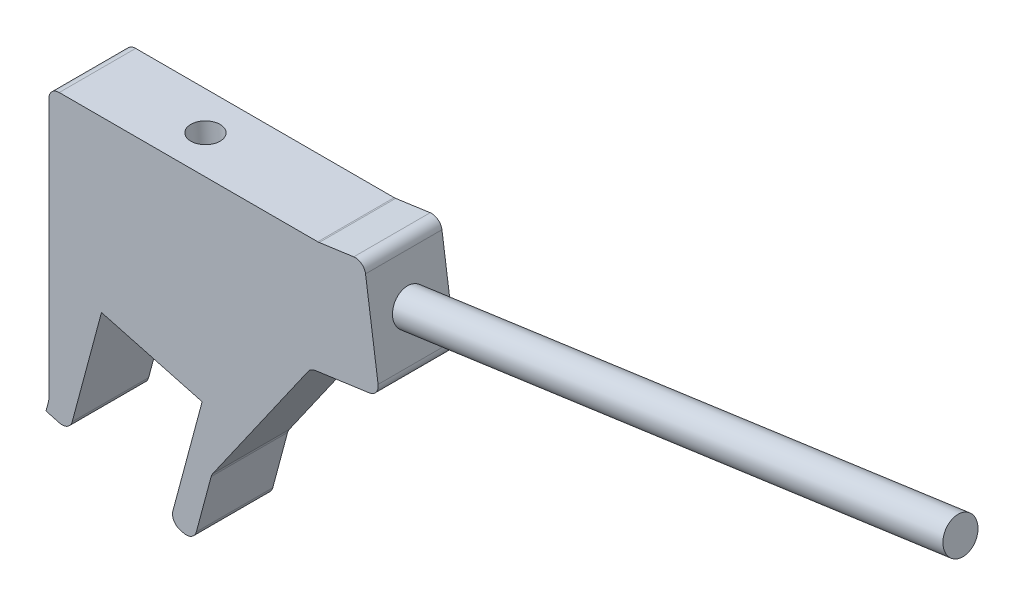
ISO-10303-21;
HEADER;
FILE_DESCRIPTION(('STEP AP214'),'2;1');
FILE_NAME('part.step','',(''),(''),'','','');
FILE_SCHEMA(('AUTOMOTIVE_DESIGN { 1 0 10303 214 1 1 1 1 }'));
ENDSEC;
DATA;
#1=APPLICATION_CONTEXT('core data for automotive mechanical design processes');
#2=APPLICATION_PROTOCOL_DEFINITION('international standard','automotive_design',2000,#1);
#3=PRODUCT_CONTEXT('',#1,'mechanical');
#4=PRODUCT('Part','Part','',(#3));
#5=PRODUCT_RELATED_PRODUCT_CATEGORY('part','',(#4));
#6=PRODUCT_DEFINITION_FORMATION('','',#4);
#7=PRODUCT_DEFINITION_CONTEXT('part definition',#1,'design');
#8=PRODUCT_DEFINITION('design','',#6,#7);
#9=PRODUCT_DEFINITION_SHAPE('','',#8);
#10=(LENGTH_UNIT() NAMED_UNIT(*) SI_UNIT(.MILLI.,.METRE.));
#11=(NAMED_UNIT(*) PLANE_ANGLE_UNIT() SI_UNIT($,.RADIAN.));
#12=(NAMED_UNIT(*) SI_UNIT($,.STERADIAN.) SOLID_ANGLE_UNIT());
#13=UNCERTAINTY_MEASURE_WITH_UNIT(LENGTH_MEASURE(1.E-05),#10,'distance_accuracy_value','');
#14=(GEOMETRIC_REPRESENTATION_CONTEXT(3) GLOBAL_UNCERTAINTY_ASSIGNED_CONTEXT((#13)) GLOBAL_UNIT_ASSIGNED_CONTEXT((#10,
#11,#12)) REPRESENTATION_CONTEXT('',''));
#15=CARTESIAN_POINT('',(0.,0.,0.));
#16=DIRECTION('',(0.,0.,1.));
#17=DIRECTION('',(1.,0.,0.));
#18=AXIS2_PLACEMENT_3D('',#15,#16,#17);
#19=CARTESIAN_POINT('',(-2.588190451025,-9.659258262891,-5.5));
#20=DIRECTION('',(-0.258819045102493,-0.965925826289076,0.));
#21=DIRECTION('',(0.965925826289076,-0.258819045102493,0.));
#22=AXIS2_PLACEMENT_3D('',#19,#20,#21);
#23=PLANE('',#22);
#24=CARTESIAN_POINT('',(-2.58819045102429,-9.65925826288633,0.));
#25=DIRECTION('',(-0.258819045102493,-0.965925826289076,0.));
#26=DIRECTION('',(0.965925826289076,-0.258819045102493,0.));
#27=AXIS2_PLACEMENT_3D('',#24,#25,#26);
#28=CIRCLE('',#27,1.6);
#29=CARTESIAN_POINT('',(-1.04270912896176,-10.0733687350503,0.));
#30=VERTEX_POINT('',#29);
#31=EDGE_CURVE('E306',#30,#30,#28,.T.);
#32=ORIENTED_EDGE('',*,*,#31,.T.);
#33=EDGE_LOOP('',(#32));
#34=FACE_BOUND('',#33,.T.);
#35=ADVANCED_FACE('F16',(#34),#23,.T.);
#36=CARTESIAN_POINT('',(105.1966057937,14.78441878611,0.));
#37=DIRECTION('',(0.990268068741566,0.139173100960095,0.));
#38=DIRECTION('',(-0.139173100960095,0.990268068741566,0.));
#39=AXIS2_PLACEMENT_3D('',#36,#37,#38);
#40=PLANE('',#39);
#41=CARTESIAN_POINT('',(105.709660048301,11.1338480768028,0.));
#42=DIRECTION('',(0.990268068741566,0.139173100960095,0.));
#43=DIRECTION('',(-0.139173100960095,0.990268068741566,0.));
#44=AXIS2_PLACEMENT_3D('',#41,#42,#43);
#45=CIRCLE('',#44,2.5);
#46=CARTESIAN_POINT('',(105.361727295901,13.6095182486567,0.));
#47=VERTEX_POINT('',#46);
#48=EDGE_CURVE('E370',#47,#47,#45,.F.);
#49=ORIENTED_EDGE('',*,*,#48,.F.);
#50=EDGE_LOOP('',(#49));
#51=FACE_BOUND('',#50,.T.);
#52=ADVANCED_FACE('F648',(#51),#40,.T.);
#53=CARTESIAN_POINT('',(0.,0.,0.));
#54=DIRECTION('',(-0.0697564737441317,0.997564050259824,0.));
#55=DIRECTION('',(-0.997564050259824,-0.0697564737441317,0.));
#56=AXIS2_PLACEMENT_3D('',#53,#54,#55);
#57=PLANE('',#56);
#58=CARTESIAN_POINT('',(-2.456985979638,-0.171809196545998,0.));
#59=DIRECTION('',(-0.0697564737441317,0.997564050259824,0.));
#60=DIRECTION('',(-0.997564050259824,-0.0697564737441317,0.));
#61=AXIS2_PLACEMENT_3D('',#58,#59,#60);
#62=CIRCLE('',#61,2.1);
#63=CARTESIAN_POINT('',(-4.55187048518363,-0.318297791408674,0.));
#64=VERTEX_POINT('',#63);
#65=EDGE_CURVE('E365',#64,#64,#62,.T.);
#66=ORIENTED_EDGE('',*,*,#65,.T.);
#67=EDGE_LOOP('',(#66));
#68=FACE_BOUND('',#67,.T.);
#69=ADVANCED_FACE('F641',(#68),#57,.T.);
#70=CARTESIAN_POINT('',(-21.5,-31.94280104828,-19.8396));
#71=DIRECTION('',(0.,0.,1.));
#72=DIRECTION('',(1.,0.,0.));
#73=AXIS2_PLACEMENT_3D('',#70,#71,#72);
#74=CYLINDRICAL_SURFACE('',#73,1.5);
#75=DIRECTION('',(0.,0.,1.));
#76=VECTOR('',#75,1.);
#77=CARTESIAN_POINT('',(-20.,-31.94280104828,-5.5));
#78=LINE('',#77,#76);
#79=CARTESIAN_POINT('',(-20.,-31.94280104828,-5.5));
#80=VERTEX_POINT('',#79);
#81=CARTESIAN_POINT('',(-20.,-31.94280104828,5.5));
#82=VERTEX_POINT('',#81);
#83=EDGE_CURVE('E185',#80,#82,#78,.T.);
#84=ORIENTED_EDGE('',*,*,#83,.F.);
#85=CARTESIAN_POINT('',(-21.5,-31.94280104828,-5.5));
#86=DIRECTION('',(0.,0.,1.));
#87=DIRECTION('',(1.,0.,0.));
#88=AXIS2_PLACEMENT_3D('',#85,#86,#87);
#89=CIRCLE('',#88,1.5);
#90=CARTESIAN_POINT('',(-20.051111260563,-32.3310296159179,-5.5));
#91=VERTEX_POINT('',#90);
#92=EDGE_CURVE('E363',#80,#91,#89,.F.);
#93=ORIENTED_EDGE('',*,*,#92,.T.);
#94=DIRECTION('',(0.,0.,1.));
#95=VECTOR('',#94,1.);
#96=CARTESIAN_POINT('',(-20.0511112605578,-32.3310296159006,-5.5));
#97=LINE('',#96,#95);
#98=CARTESIAN_POINT('',(-20.0511112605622,-32.3310296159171,5.5));
#99=VERTEX_POINT('',#98);
#100=EDGE_CURVE('E174',#99,#91,#97,.F.);
#101=ORIENTED_EDGE('',*,*,#100,.F.);
#102=CARTESIAN_POINT('',(-21.5,-31.94280104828,5.5));
#103=DIRECTION('',(0.,0.,1.));
#104=DIRECTION('',(1.,0.,0.));
#105=AXIS2_PLACEMENT_3D('',#102,#103,#104);
#106=CIRCLE('',#105,1.5);
#107=EDGE_CURVE('E20',#82,#99,#106,.F.);
#108=ORIENTED_EDGE('',*,*,#107,.F.);
#109=EDGE_LOOP('',(#84,#93,#101,#108));
#110=FACE_BOUND('',#109,.T.);
#111=ADVANCED_FACE('F634',(#110),#74,.F.);
#112=CARTESIAN_POINT('',(-20.,-32.14027979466,-5.5));
#113=DIRECTION('',(-0.965925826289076,0.258819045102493,0.));
#114=DIRECTION('',(-0.258819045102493,-0.965925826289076,0.));
#115=AXIS2_PLACEMENT_3D('',#112,#113,#114);
#116=PLANE('',#115);
#117=DIRECTION('',(-0.258819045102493,-0.965925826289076,0.));
#118=VECTOR('',#117,1.);
#119=CARTESIAN_POINT('',(-20.,-32.14027979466,5.5));
#120=LINE('',#119,#118);
#121=CARTESIAN_POINT('',(-20.4051736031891,-33.6524082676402,5.5));
#122=VERTEX_POINT('',#121);
#123=EDGE_CURVE('E165',#122,#99,#120,.F.);
#124=ORIENTED_EDGE('',*,*,#123,.T.);
#125=ORIENTED_EDGE('',*,*,#100,.T.);
#126=DIRECTION('',(-0.258819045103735,-0.965925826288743,0.));
#127=VECTOR('',#126,1.);
#128=CARTESIAN_POINT('',(-20.05111126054,-32.33102961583,-5.5));
#129=LINE('',#128,#127);
#130=CARTESIAN_POINT('',(-20.40517360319,-33.65240826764,-5.5));
#131=VERTEX_POINT('',#130);
#132=EDGE_CURVE('E181',#91,#131,#129,.T.);
#133=ORIENTED_EDGE('',*,*,#132,.T.);
#134=DIRECTION('',(0.,0.,1.));
#135=VECTOR('',#134,1.);
#136=CARTESIAN_POINT('',(-20.40517360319,-33.65240826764,-5.5));
#137=LINE('',#136,#135);
#138=EDGE_CURVE('E178',#122,#131,#137,.F.);
#139=ORIENTED_EDGE('',*,*,#138,.F.);
#140=EDGE_LOOP('',(#124,#125,#133,#139));
#141=FACE_BOUND('',#140,.T.);
#142=ADVANCED_FACE('F179',(#141),#116,.T.);
#143=CARTESIAN_POINT('',(-5.17638090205,-19.31851652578,0.));
#144=DIRECTION('',(-0.258819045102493,-0.965925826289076,0.));
#145=DIRECTION('',(0.965925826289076,-0.258819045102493,0.));
#146=AXIS2_PLACEMENT_3D('',#143,#144,#145);
#147=CYLINDRICAL_SURFACE('',#146,1.6);
#148=ORIENTED_EDGE('',*,*,#31,.F.);
#149=EDGE_LOOP('',(#148));
#150=FACE_BOUND('',#149,.T.);
#151=CARTESIAN_POINT('',(-5.17638090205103,-19.3185165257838,0.));
#152=DIRECTION('',(-0.258819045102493,-0.965925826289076,0.));
#153=DIRECTION('',(0.965925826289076,-0.258819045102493,0.));
#154=AXIS2_PLACEMENT_3D('',#151,#152,#153);
#155=CIRCLE('',#154,1.6);
#156=CARTESIAN_POINT('',(-3.63089957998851,-19.7326269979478,0.));
#157=VERTEX_POINT('',#156);
#158=EDGE_CURVE('E266',#157,#157,#155,.F.);
#159=ORIENTED_EDGE('',*,*,#158,.F.);
#160=EDGE_LOOP('',(#159));
#161=FACE_BOUND('',#160,.T.);
#162=ADVANCED_FACE('F379',(#150,#161),#147,.F.);
#163=CARTESIAN_POINT('',(-2.535545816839,-38.44056060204,-5.5));
#164=DIRECTION('',(-0.258819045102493,-0.965925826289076,0.));
#165=DIRECTION('',(0.965925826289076,-0.258819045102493,0.));
#166=AXIS2_PLACEMENT_3D('',#163,#164,#165);
#167=PLANE('',#166);
#168=DIRECTION('',(0.96592582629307,-0.258819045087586,0.));
#169=VECTOR('',#168,1.);
#170=CARTESIAN_POINT('',(-1.086657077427,-38.82878916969,-5.5));
#171=LINE('',#170,#169);
#172=CARTESIAN_POINT('',(-1.08665707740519,-38.8287891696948,-5.5));
#173=VERTEX_POINT('',#172);
#174=CARTESIAN_POINT('',(-0.60369416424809,-38.9581986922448,-5.5));
#175=VERTEX_POINT('',#174);
#176=EDGE_CURVE('E362',#173,#175,#171,.T.);
#177=ORIENTED_EDGE('',*,*,#176,.T.);
#178=DIRECTION('',(0.,0.,-1.));
#179=VECTOR('',#178,1.);
#180=CARTESIAN_POINT('',(-0.603694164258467,-38.9581986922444,19.8396));
#181=LINE('',#180,#179);
#182=CARTESIAN_POINT('',(-0.603694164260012,-38.9581986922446,5.5));
#183=VERTEX_POINT('',#182);
#184=EDGE_CURVE('E251',#183,#175,#181,.T.);
#185=ORIENTED_EDGE('',*,*,#184,.F.);
#186=DIRECTION('',(0.965925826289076,-0.258819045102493,0.));
#187=VECTOR('',#186,1.);
#188=CARTESIAN_POINT('',(-2.535545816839,-38.44056060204,5.5));
#189=LINE('',#188,#187);
#190=CARTESIAN_POINT('',(-1.08665707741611,-38.8287891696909,5.5));
#191=VERTEX_POINT('',#190);
#192=EDGE_CURVE('E303',#183,#191,#189,.F.);
#193=ORIENTED_EDGE('',*,*,#192,.T.);
#194=DIRECTION('',(0.,0.,-1.));
#195=VECTOR('',#194,1.);
#196=CARTESIAN_POINT('',(-1.08665707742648,-38.8287891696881,19.8396));
#197=LINE('',#196,#195);
#198=EDGE_CURVE('E256',#173,#191,#197,.F.);
#199=ORIENTED_EDGE('',*,*,#198,.F.);
#200=EDGE_LOOP('',(#177,#185,#193,#199));
#201=FACE_BOUND('',#200,.T.);
#202=ADVANCED_FACE('F382',(#201),#167,.T.);
#203=CARTESIAN_POINT('',(4.813818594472,-30.33087574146,-19.8396));
#204=DIRECTION('',(0.,0.,1.));
#205=DIRECTION('',(1.,0.,0.));
#206=AXIS2_PLACEMENT_3D('',#203,#204,#205);
#207=CYLINDRICAL_SURFACE('',#206,1.5);
#208=DIRECTION('',(0.,0.,1.));
#209=VECTOR('',#208,1.);
#210=CARTESIAN_POINT('',(3.36492985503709,-29.9426471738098,-5.5));
#211=LINE('',#210,#209);
#212=CARTESIAN_POINT('',(3.36492985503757,-29.942647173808,-5.5));
#213=VERTEX_POINT('',#212);
#214=CARTESIAN_POINT('',(3.36492985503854,-29.942647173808,5.5));
#215=VERTEX_POINT('',#214);
#216=EDGE_CURVE('E247',#213,#215,#211,.T.);
#217=ORIENTED_EDGE('',*,*,#216,.F.);
#218=CARTESIAN_POINT('',(4.813818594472,-30.33087574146,-5.5));
#219=DIRECTION('',(0.,0.,1.));
#220=DIRECTION('',(1.,0.,0.));
#221=AXIS2_PLACEMENT_3D('',#218,#219,#220);
#222=CIRCLE('',#221,1.5);
#223=CARTESIAN_POINT('',(3.58509052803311,-29.4705110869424,-5.5));
#224=VERTEX_POINT('',#223);
#225=EDGE_CURVE('E360',#213,#224,#222,.F.);
#226=ORIENTED_EDGE('',*,*,#225,.T.);
#227=DIRECTION('',(0.,0.,1.));
#228=VECTOR('',#227,1.);
#229=CARTESIAN_POINT('',(3.58509052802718,-29.4705110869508,-5.5));
#230=LINE('',#229,#228);
#231=CARTESIAN_POINT('',(3.58509052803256,-29.4705110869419,5.5));
#232=VERTEX_POINT('',#231);
#233=EDGE_CURVE('E238',#232,#224,#230,.F.);
#234=ORIENTED_EDGE('',*,*,#233,.F.);
#235=CARTESIAN_POINT('',(4.813818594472,-30.33087574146,5.5));
#236=DIRECTION('',(0.,0.,1.));
#237=DIRECTION('',(1.,0.,0.));
#238=AXIS2_PLACEMENT_3D('',#235,#236,#237);
#239=CIRCLE('',#238,1.5);
#240=EDGE_CURVE('E305',#215,#232,#239,.F.);
#241=ORIENTED_EDGE('',*,*,#240,.F.);
#242=EDGE_LOOP('',(#217,#226,#234,#241));
#243=FACE_BOUND('',#242,.T.);
#244=ADVANCED_FACE('F609',(#243),#207,.F.);
#245=CARTESIAN_POINT('',(18.55354953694,-10.70850638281,-19.8396));
#246=DIRECTION('',(0.,0.,1.));
#247=DIRECTION('',(1.,0.,0.));
#248=AXIS2_PLACEMENT_3D('',#245,#246,#247);
#249=CYLINDRICAL_SURFACE('',#248,1.5);
#250=DIRECTION('',(0.,0.,1.));
#251=VECTOR('',#250,1.);
#252=CARTESIAN_POINT('',(17.3248214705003,-9.84814172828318,-5.5));
#253=LINE('',#252,#251);
#254=CARTESIAN_POINT('',(17.3248214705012,-9.84814172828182,-5.5));
#255=VERTEX_POINT('',#254);
#256=CARTESIAN_POINT('',(17.3248214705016,-9.848141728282,5.5));
#257=VERTEX_POINT('',#256);
#258=EDGE_CURVE('E237',#255,#257,#253,.T.);
#259=ORIENTED_EDGE('',*,*,#258,.F.);
#260=CARTESIAN_POINT('',(18.55354953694,-10.70850638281,-5.5));
#261=DIRECTION('',(0.,0.,1.));
#262=DIRECTION('',(1.,0.,0.));
#263=AXIS2_PLACEMENT_3D('',#260,#261,#262);
#264=CIRCLE('',#263,1.5);
#265=CARTESIAN_POINT('',(18.3447898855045,-9.22310427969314,-5.5));
#266=VERTEX_POINT('',#265);
#267=EDGE_CURVE('E358',#255,#266,#264,.F.);
#268=ORIENTED_EDGE('',*,*,#267,.T.);
#269=DIRECTION('',(0.,0.,1.));
#270=VECTOR('',#269,1.);
#271=CARTESIAN_POINT('',(18.3447898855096,-9.22310427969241,-5.5));
#272=LINE('',#271,#270);
#273=CARTESIAN_POINT('',(18.3447898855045,-9.22310427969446,5.5));
#274=VERTEX_POINT('',#273);
#275=EDGE_CURVE('E234',#274,#266,#272,.F.);
#276=ORIENTED_EDGE('',*,*,#275,.F.);
#277=CARTESIAN_POINT('',(18.55354953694,-10.70850638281,5.5));
#278=DIRECTION('',(0.,0.,1.));
#279=DIRECTION('',(1.,0.,0.));
#280=AXIS2_PLACEMENT_3D('',#277,#278,#279);
#281=CIRCLE('',#280,1.5);
#282=EDGE_CURVE('E373',#257,#274,#281,.F.);
#283=ORIENTED_EDGE('',*,*,#282,.F.);
#284=EDGE_LOOP('',(#259,#268,#276,#283));
#285=FACE_BOUND('',#284,.T.);
#286=ADVANCED_FACE('F601',(#285),#249,.F.);
#287=CARTESIAN_POINT('',(26.48821454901,0.,0.));
#288=DIRECTION('',(0.990268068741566,0.139173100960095,0.));
#289=DIRECTION('',(-0.139173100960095,0.990268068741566,0.));
#290=AXIS2_PLACEMENT_3D('',#287,#288,#289);
#291=CYLINDRICAL_SURFACE('',#290,2.5);
#292=ORIENTED_EDGE('',*,*,#48,.T.);
#293=EDGE_LOOP('',(#292));
#294=FACE_BOUND('',#293,.T.);
#295=CARTESIAN_POINT('',(26.48821454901,0.,0.));
#296=DIRECTION('',(0.990268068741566,0.139173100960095,0.));
#297=DIRECTION('',(-0.139173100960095,0.990268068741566,0.));
#298=AXIS2_PLACEMENT_3D('',#295,#296,#297);
#299=CIRCLE('',#298,2.5);
#300=CARTESIAN_POINT('',(26.1402817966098,2.47567017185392,0.));
#301=VERTEX_POINT('',#300);
#302=EDGE_CURVE('E224',#301,#301,#299,.F.);
#303=ORIENTED_EDGE('',*,*,#302,.F.);
#304=EDGE_LOOP('',(#303));
#305=FACE_BOUND('',#304,.T.);
#306=ADVANCED_FACE('F593',(#294,#305),#291,.T.);
#307=CARTESIAN_POINT('',(18.70854011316,8.5,-19.8396));
#308=DIRECTION('',(0.,0.,1.));
#309=DIRECTION('',(1.,0.,0.));
#310=AXIS2_PLACEMENT_3D('',#307,#308,#309);
#311=CYLINDRICAL_SURFACE('',#310,1.5);
#312=DIRECTION('',(0.,0.,1.));
#313=VECTOR('',#312,1.);
#314=CARTESIAN_POINT('',(18.70854011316,7.,-5.5));
#315=LINE('',#314,#313);
#316=CARTESIAN_POINT('',(18.70854011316,7.,5.5));
#317=VERTEX_POINT('',#316);
#318=CARTESIAN_POINT('',(18.70854011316,7.,-5.5));
#319=VERTEX_POINT('',#318);
#320=EDGE_CURVE('E209',#317,#319,#315,.F.);
#321=ORIENTED_EDGE('',*,*,#320,.F.);
#322=CARTESIAN_POINT('',(18.70854011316,8.5,5.5));
#323=DIRECTION('',(0.,0.,1.));
#324=DIRECTION('',(1.,0.,0.));
#325=AXIS2_PLACEMENT_3D('',#322,#323,#324);
#326=CIRCLE('',#325,1.5);
#327=CARTESIAN_POINT('',(18.9172997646,7.01459789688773,5.5));
#328=VERTEX_POINT('',#327);
#329=EDGE_CURVE('E368',#328,#317,#326,.F.);
#330=ORIENTED_EDGE('',*,*,#329,.F.);
#331=DIRECTION('',(0.,0.,1.));
#332=VECTOR('',#331,1.);
#333=CARTESIAN_POINT('',(18.9172997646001,7.01459789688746,-5.5));
#334=LINE('',#333,#332);
#335=CARTESIAN_POINT('',(18.9172997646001,7.01459789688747,-5.5));
#336=VERTEX_POINT('',#335);
#337=EDGE_CURVE('E216',#336,#328,#334,.T.);
#338=ORIENTED_EDGE('',*,*,#337,.F.);
#339=CARTESIAN_POINT('',(18.70854011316,8.5,-5.5));
#340=DIRECTION('',(0.,0.,1.));
#341=DIRECTION('',(1.,0.,0.));
#342=AXIS2_PLACEMENT_3D('',#339,#340,#341);
#343=CIRCLE('',#342,1.5);
#344=EDGE_CURVE('E294',#336,#319,#343,.F.);
#345=ORIENTED_EDGE('',*,*,#344,.T.);
#346=EDGE_LOOP('',(#321,#330,#338,#345));
#347=FACE_BOUND('',#346,.T.);
#348=ADVANCED_FACE('F585',(#347),#311,.F.);
#349=CARTESIAN_POINT('',(-2.456985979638,-0.171809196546,0.));
#350=DIRECTION('',(-0.0697564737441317,0.997564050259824,0.));
#351=DIRECTION('',(-0.997564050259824,-0.0697564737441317,0.));
#352=AXIS2_PLACEMENT_3D('',#349,#350,#351);
#353=CYLINDRICAL_SURFACE('',#352,2.1);
#354=ORIENTED_EDGE('',*,*,#65,.F.);
#355=EDGE_LOOP('',(#354));
#356=FACE_BOUND('',#355,.T.);
#357=CARTESIAN_POINT('',(-2.95848773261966,7.,0.));
#358=DIRECTION('',(0.,1.,0.));
#359=DIRECTION('',(-1.,0.,0.));
#360=AXIS2_PLACEMENT_3D('',#357,#358,#359);
#361=ELLIPSE('',#360,2.10512798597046,2.1);
#362=CARTESIAN_POINT('',(-5.06361571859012,7.,0.));
#363=VERTEX_POINT('',#362);
#364=EDGE_CURVE('E207',#363,#363,#361,.F.);
#365=ORIENTED_EDGE('',*,*,#364,.F.);
#366=EDGE_LOOP('',(#365));
#367=FACE_BOUND('',#366,.T.);
#368=ADVANCED_FACE('F578',(#356,#367),#353,.F.);
#369=CARTESIAN_POINT('',(0.,0.,-5.5));
#370=DIRECTION('',(0.,0.,1.));
#371=DIRECTION('',(1.,0.,0.));
#372=AXIS2_PLACEMENT_3D('',#369,#370,#371);
#373=PLANE('',#372);
#374=ORIENTED_EDGE('',*,*,#344,.F.);
#375=DIRECTION('',(-0.990268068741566,-0.139173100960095,0.));
#376=VECTOR('',#375,1.);
#377=CARTESIAN_POINT('',(25.37482974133,7.922144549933,-5.5));
#378=LINE('',#377,#376);
#379=CARTESIAN_POINT('',(23.8894276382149,7.71338489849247,-5.5));
#380=VERTEX_POINT('',#379);
#381=EDGE_CURVE('E219',#380,#336,#378,.T.);
#382=ORIENTED_EDGE('',*,*,#381,.F.);
#383=CARTESIAN_POINT('',(24.09818728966,6.22798279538,-5.5));
#384=DIRECTION('',(0.,0.,-1.));
#385=DIRECTION('',(-1.,0.,0.));
#386=AXIS2_PLACEMENT_3D('',#383,#384,#385);
#387=CIRCLE('',#386,1.5);
#388=CARTESIAN_POINT('',(25.58358939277,6.43674244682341,-5.5));
#389=VERTEX_POINT('',#388);
#390=EDGE_CURVE('E223',#389,#380,#387,.F.);
#391=ORIENTED_EDGE('',*,*,#390,.F.);
#392=DIRECTION('',(-0.139173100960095,0.990268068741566,0.));
#393=VECTOR('',#392,1.);
#394=CARTESIAN_POINT('',(27.60159935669,-7.922144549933,-5.5));
#395=LINE('',#394,#393);
#396=CARTESIAN_POINT('',(27.3928397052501,-6.43674244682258,-5.5));
#397=VERTEX_POINT('',#396);
#398=EDGE_CURVE('E228',#397,#389,#395,.T.);
#399=ORIENTED_EDGE('',*,*,#398,.F.);
#400=CARTESIAN_POINT('',(25.90743760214,-6.64550209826,-5.5));
#401=DIRECTION('',(0.,0.,-1.));
#402=DIRECTION('',(-1.,0.,0.));
#403=AXIS2_PLACEMENT_3D('',#400,#401,#402);
#404=CIRCLE('',#403,1.5);
#405=CARTESIAN_POINT('',(26.11619725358,-8.13090420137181,-5.5));
#406=VERTEX_POINT('',#405);
#407=EDGE_CURVE('E229',#406,#397,#404,.F.);
#408=ORIENTED_EDGE('',*,*,#407,.F.);
#409=DIRECTION('',(0.990268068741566,0.139173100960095,0.));
#410=VECTOR('',#409,1.);
#411=CARTESIAN_POINT('',(17.69891866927,-9.313875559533,-5.5));
#412=LINE('',#411,#410);
#413=EDGE_CURVE('E233',#266,#406,#412,.T.);
#414=ORIENTED_EDGE('',*,*,#413,.F.);
#415=ORIENTED_EDGE('',*,*,#267,.F.);
#416=DIRECTION('',(0.573576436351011,0.819152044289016,0.));
#417=VECTOR('',#416,1.);
#418=CARTESIAN_POINT('',(3.433385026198,-29.687168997,-5.5));
#419=LINE('',#418,#417);
#420=EDGE_CURVE('E241',#224,#255,#419,.T.);
#421=ORIENTED_EDGE('',*,*,#420,.F.);
#422=ORIENTED_EDGE('',*,*,#225,.F.);
#423=DIRECTION('',(0.258819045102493,0.965925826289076,0.));
#424=VECTOR('',#423,1.);
#425=CARTESIAN_POINT('',(0.8451945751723,-39.34642725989,-5.5));
#426=LINE('',#425,#424);
#427=CARTESIAN_POINT('',(1.23342314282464,-37.8975385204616,-5.5));
#428=VERTEX_POINT('',#427);
#429=EDGE_CURVE('E250',#428,#213,#426,.T.);
#430=ORIENTED_EDGE('',*,*,#429,.F.);
#431=CARTESIAN_POINT('',(-0.2154655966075,-37.50930995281,-5.5));
#432=DIRECTION('',(0.,0.,-1.));
#433=DIRECTION('',(-1.,0.,0.));
#434=AXIS2_PLACEMENT_3D('',#431,#432,#433);
#435=CIRCLE('',#434,1.5);
#436=EDGE_CURVE('E254',#175,#428,#435,.F.);
#437=ORIENTED_EDGE('',*,*,#436,.F.);
#438=ORIENTED_EDGE('',*,*,#176,.F.);
#439=CARTESIAN_POINT('',(-0.698428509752,-37.37990043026,-5.5));
#440=DIRECTION('',(0.,0.,-1.));
#441=DIRECTION('',(-1.,0.,0.));
#442=AXIS2_PLACEMENT_3D('',#439,#440,#441);
#443=CIRCLE('',#442,1.5);
#444=CARTESIAN_POINT('',(-2.14731724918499,-36.9916718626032,-5.5));
#445=VERTEX_POINT('',#444);
#446=EDGE_CURVE('E255',#445,#173,#443,.F.);
#447=ORIENTED_EDGE('',*,*,#446,.F.);
#448=DIRECTION('',(-0.258819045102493,-0.965925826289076,0.));
#449=VECTOR('',#448,1.);
#450=CARTESIAN_POINT('',(2.068062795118,-21.25965936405,-5.5));
#451=LINE('',#450,#449);
#452=CARTESIAN_POINT('',(2.06806279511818,-21.2596593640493,-5.5));
#453=VERTEX_POINT('',#452);
#454=EDGE_CURVE('E260',#453,#445,#451,.T.);
#455=ORIENTED_EDGE('',*,*,#454,.F.);
#456=DIRECTION('',(0.965925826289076,-0.258819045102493,0.));
#457=VECTOR('',#456,1.);
#458=CARTESIAN_POINT('',(-12.42082459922,-17.37737368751,-5.5));
#459=LINE('',#458,#457);
#460=CARTESIAN_POINT('',(-12.4208245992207,-17.3773736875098,-5.5));
#461=VERTEX_POINT('',#460);
#462=EDGE_CURVE('E278',#461,#453,#459,.T.);
#463=ORIENTED_EDGE('',*,*,#462,.F.);
#464=DIRECTION('',(0.258819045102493,0.965925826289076,0.));
#465=VECTOR('',#464,1.);
#466=CARTESIAN_POINT('',(-17.02443321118,-34.5582749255,-5.5));
#467=LINE('',#466,#465);
#468=CARTESIAN_POINT('',(-16.6362046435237,-33.1093861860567,-5.5));
#469=VERTEX_POINT('',#468);
#470=EDGE_CURVE('E284',#469,#461,#467,.T.);
#471=ORIENTED_EDGE('',*,*,#470,.F.);
#472=CARTESIAN_POINT('',(-18.08509338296,-32.72115761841,-5.5));
#473=DIRECTION('',(0.,0.,-1.));
#474=DIRECTION('',(-1.,0.,0.));
#475=AXIS2_PLACEMENT_3D('',#472,#473,#474);
#476=CIRCLE('',#475,1.5);
#477=CARTESIAN_POINT('',(-18.4733219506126,-34.1700463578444,-5.5));
#478=VERTEX_POINT('',#477);
#479=EDGE_CURVE('E285',#478,#469,#476,.F.);
#480=ORIENTED_EDGE('',*,*,#479,.F.);
#481=DIRECTION('',(0.965925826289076,-0.258819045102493,0.));
#482=VECTOR('',#481,1.);
#483=CARTESIAN_POINT('',(-20.40517360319,-33.65240826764,-5.5));
#484=LINE('',#483,#482);
#485=EDGE_CURVE('E184',#131,#478,#484,.T.);
#486=ORIENTED_EDGE('',*,*,#485,.F.);
#487=ORIENTED_EDGE('',*,*,#132,.F.);
#488=ORIENTED_EDGE('',*,*,#92,.F.);
#489=DIRECTION('',(0.,1.,0.));
#490=VECTOR('',#489,1.);
#491=CARTESIAN_POINT('',(-20.,7.,-5.5));
#492=LINE('',#491,#490);
#493=CARTESIAN_POINT('',(-20.,5.5,-5.5));
#494=VERTEX_POINT('',#493);
#495=EDGE_CURVE('E290',#494,#80,#492,.F.);
#496=ORIENTED_EDGE('',*,*,#495,.F.);
#497=CARTESIAN_POINT('',(-18.5,5.5,-5.5));
#498=DIRECTION('',(0.,0.,-1.));
#499=DIRECTION('',(-1.,0.,0.));
#500=AXIS2_PLACEMENT_3D('',#497,#498,#499);
#501=CIRCLE('',#500,1.5);
#502=CARTESIAN_POINT('',(-18.5,7.,-5.5));
#503=VERTEX_POINT('',#502);
#504=EDGE_CURVE('E196',#503,#494,#501,.F.);
#505=ORIENTED_EDGE('',*,*,#504,.F.);
#506=DIRECTION('',(1.,0.,0.));
#507=VECTOR('',#506,1.);
#508=CARTESIAN_POINT('',(18.81343033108,7.,-5.5));
#509=LINE('',#508,#507);
#510=EDGE_CURVE('E212',#319,#503,#509,.F.);
#511=ORIENTED_EDGE('',*,*,#510,.F.);
#512=EDGE_LOOP('',(#374,#382,#391,#399,#408,#414,#415,#421,#422,#430,#437,#438,#447,#455,#463,
#471,#480,#486,#487,#488,#496,#505,#511));
#513=FACE_BOUND('',#512,.T.);
#514=ADVANCED_FACE('F434',(#513),#373,.F.);
#515=CARTESIAN_POINT('',(-20.,7.,-5.5));
#516=DIRECTION('',(-1.,0.,0.));
#517=DIRECTION('',(0.,0.,1.));
#518=AXIS2_PLACEMENT_3D('',#515,#516,#517);
#519=PLANE('',#518);
#520=DIRECTION('',(0.,1.,0.));
#521=VECTOR('',#520,1.);
#522=CARTESIAN_POINT('',(-20.,0.,5.5));
#523=LINE('',#522,#521);
#524=CARTESIAN_POINT('',(-20.,5.5,5.5));
#525=VERTEX_POINT('',#524);
#526=EDGE_CURVE('E192',#525,#82,#523,.F.);
#527=ORIENTED_EDGE('',*,*,#526,.F.);
#528=DIRECTION('',(0.,0.,-1.));
#529=VECTOR('',#528,1.);
#530=CARTESIAN_POINT('',(-20.,5.5,19.8396));
#531=LINE('',#530,#529);
#532=EDGE_CURVE('E204',#494,#525,#531,.F.);
#533=ORIENTED_EDGE('',*,*,#532,.F.);
#534=ORIENTED_EDGE('',*,*,#495,.T.);
#535=ORIENTED_EDGE('',*,*,#83,.T.);
#536=EDGE_LOOP('',(#527,#533,#534,#535));
#537=FACE_BOUND('',#536,.T.);
#538=ADVANCED_FACE('F451',(#537),#519,.T.);
#539=CARTESIAN_POINT('',(-20.40517360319,-33.65240826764,-5.5));
#540=DIRECTION('',(-0.258819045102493,-0.965925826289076,0.));
#541=DIRECTION('',(0.965925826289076,-0.258819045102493,0.));
#542=AXIS2_PLACEMENT_3D('',#539,#540,#541);
#543=PLANE('',#542);
#544=ORIENTED_EDGE('',*,*,#485,.T.);
#545=DIRECTION('',(0.,0.,-1.));
#546=VECTOR('',#545,1.);
#547=CARTESIAN_POINT('',(-18.4733219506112,-34.1700463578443,19.8396));
#548=LINE('',#547,#546);
#549=CARTESIAN_POINT('',(-18.47332195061,-34.1700463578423,5.5));
#550=VERTEX_POINT('',#549);
#551=EDGE_CURVE('E189',#550,#478,#548,.T.);
#552=ORIENTED_EDGE('',*,*,#551,.F.);
#553=DIRECTION('',(0.965925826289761,-0.258819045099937,0.));
#554=VECTOR('',#553,1.);
#555=CARTESIAN_POINT('',(-20.40517360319,-33.65240826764,5.5));
#556=LINE('',#555,#554);
#557=EDGE_CURVE('E170',#122,#550,#556,.T.);
#558=ORIENTED_EDGE('',*,*,#557,.F.);
#559=ORIENTED_EDGE('',*,*,#138,.T.);
#560=EDGE_LOOP('',(#544,#552,#558,#559));
#561=FACE_BOUND('',#560,.T.);
#562=ADVANCED_FACE('F187',(#561),#543,.T.);
#563=CARTESIAN_POINT('',(-18.08509338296,-32.72115761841,19.8396));
#564=DIRECTION('',(0.,0.,-1.));
#565=DIRECTION('',(-1.,0.,0.));
#566=AXIS2_PLACEMENT_3D('',#563,#564,#565);
#567=CYLINDRICAL_SURFACE('',#566,1.5);
#568=ORIENTED_EDGE('',*,*,#551,.T.);
#569=ORIENTED_EDGE('',*,*,#479,.T.);
#570=DIRECTION('',(0.,0.,1.));
#571=VECTOR('',#570,1.);
#572=CARTESIAN_POINT('',(-16.6362046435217,-33.1093861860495,-5.5));
#573=LINE('',#572,#571);
#574=CARTESIAN_POINT('',(-16.6362046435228,-33.109386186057,5.5));
#575=VERTEX_POINT('',#574);
#576=EDGE_CURVE('E279',#575,#469,#573,.F.);
#577=ORIENTED_EDGE('',*,*,#576,.F.);
#578=CARTESIAN_POINT('',(-18.08509338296,-32.72115761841,5.5));
#579=DIRECTION('',(0.,0.,-1.));
#580=DIRECTION('',(-1.,0.,0.));
#581=AXIS2_PLACEMENT_3D('',#578,#579,#580);
#582=CIRCLE('',#581,1.5);
#583=EDGE_CURVE('E191',#550,#575,#582,.F.);
#584=ORIENTED_EDGE('',*,*,#583,.F.);
#585=EDGE_LOOP('',(#568,#569,#577,#584));
#586=FACE_BOUND('',#585,.T.);
#587=ADVANCED_FACE('F442',(#586),#567,.T.);
#588=CARTESIAN_POINT('',(-17.02443321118,-34.5582749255,-5.5));
#589=DIRECTION('',(0.965925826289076,-0.258819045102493,0.));
#590=DIRECTION('',(0.258819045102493,0.965925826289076,0.));
#591=AXIS2_PLACEMENT_3D('',#588,#589,#590);
#592=PLANE('',#591);
#593=DIRECTION('',(0.258819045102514,0.96592582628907,0.));
#594=VECTOR('',#593,1.);
#595=CARTESIAN_POINT('',(-16.63620464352,-33.10938618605,5.5));
#596=LINE('',#595,#594);
#597=CARTESIAN_POINT('',(-12.42082459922,-17.37737368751,5.5));
#598=VERTEX_POINT('',#597);
#599=EDGE_CURVE('E194',#575,#598,#596,.T.);
#600=ORIENTED_EDGE('',*,*,#599,.F.);
#601=ORIENTED_EDGE('',*,*,#576,.T.);
#602=ORIENTED_EDGE('',*,*,#470,.T.);
#603=DIRECTION('',(0.,0.,1.));
#604=VECTOR('',#603,1.);
#605=CARTESIAN_POINT('',(-12.42082459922,-17.37737368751,-5.5));
#606=LINE('',#605,#604);
#607=EDGE_CURVE('E275',#598,#461,#606,.F.);
#608=ORIENTED_EDGE('',*,*,#607,.F.);
#609=EDGE_LOOP('',(#600,#601,#602,#608));
#610=FACE_BOUND('',#609,.T.);
#611=ADVANCED_FACE('F390',(#610),#592,.T.);
#612=CARTESIAN_POINT('',(-12.42082459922,-17.37737368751,-5.5));
#613=DIRECTION('',(-0.258819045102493,-0.965925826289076,0.));
#614=DIRECTION('',(0.965925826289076,-0.258819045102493,0.));
#615=AXIS2_PLACEMENT_3D('',#612,#613,#614);
#616=PLANE('',#615);
#617=ORIENTED_EDGE('',*,*,#158,.T.);
#618=EDGE_LOOP('',(#617));
#619=FACE_BOUND('',#618,.T.);
#620=ORIENTED_EDGE('',*,*,#607,.T.);
#621=ORIENTED_EDGE('',*,*,#462,.T.);
#622=DIRECTION('',(0.,0.,1.));
#623=VECTOR('',#622,1.);
#624=CARTESIAN_POINT('',(2.068062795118,-21.25965936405,-5.5));
#625=LINE('',#624,#623);
#626=CARTESIAN_POINT('',(2.068062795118,-21.25965936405,5.5));
#627=VERTEX_POINT('',#626);
#628=EDGE_CURVE('E263',#627,#453,#625,.F.);
#629=ORIENTED_EDGE('',*,*,#628,.F.);
#630=DIRECTION('',(0.965925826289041,-0.258819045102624,0.));
#631=VECTOR('',#630,1.);
#632=CARTESIAN_POINT('',(-12.42082459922,-17.37737368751,5.5));
#633=LINE('',#632,#631);
#634=EDGE_CURVE('E269',#598,#627,#633,.T.);
#635=ORIENTED_EDGE('',*,*,#634,.F.);
#636=EDGE_LOOP('',(#620,#621,#629,#635));
#637=FACE_BOUND('',#636,.T.);
#638=ADVANCED_FACE('F386',(#619,#637),#616,.T.);
#639=CARTESIAN_POINT('',(2.068062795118,-21.25965936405,-5.5));
#640=DIRECTION('',(-0.965925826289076,0.258819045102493,0.));
#641=DIRECTION('',(-0.258819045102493,-0.965925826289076,0.));
#642=AXIS2_PLACEMENT_3D('',#639,#640,#641);
#643=PLANE('',#642);
#644=ORIENTED_EDGE('',*,*,#454,.T.);
#645=DIRECTION('',(0.,0.,-1.));
#646=VECTOR('',#645,1.);
#647=CARTESIAN_POINT('',(-2.14731724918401,-36.9916718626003,19.8396));
#648=LINE('',#647,#646);
#649=CARTESIAN_POINT('',(-2.1473172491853,-36.9916718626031,5.5));
#650=VERTEX_POINT('',#649);
#651=EDGE_CURVE('E259',#650,#445,#648,.T.);
#652=ORIENTED_EDGE('',*,*,#651,.F.);
#653=DIRECTION('',(-0.258819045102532,-0.965925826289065,0.));
#654=VECTOR('',#653,1.);
#655=CARTESIAN_POINT('',(2.068062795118,-21.25965936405,5.5));
#656=LINE('',#655,#654);
#657=EDGE_CURVE('E272',#627,#650,#656,.T.);
#658=ORIENTED_EDGE('',*,*,#657,.F.);
#659=ORIENTED_EDGE('',*,*,#628,.T.);
#660=EDGE_LOOP('',(#644,#652,#658,#659));
#661=FACE_BOUND('',#660,.T.);
#662=ADVANCED_FACE('F389',(#661),#643,.T.);
#663=CARTESIAN_POINT('',(-0.698428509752,-37.37990043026,19.8396));
#664=DIRECTION('',(0.,0.,-1.));
#665=DIRECTION('',(-1.,0.,0.));
#666=AXIS2_PLACEMENT_3D('',#663,#664,#665);
#667=CYLINDRICAL_SURFACE('',#666,1.5);
#668=ORIENTED_EDGE('',*,*,#651,.T.);
#669=ORIENTED_EDGE('',*,*,#446,.T.);
#670=ORIENTED_EDGE('',*,*,#198,.T.);
#671=CARTESIAN_POINT('',(-0.698428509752,-37.37990043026,5.5));
#672=DIRECTION('',(0.,0.,-1.));
#673=DIRECTION('',(-1.,0.,0.));
#674=AXIS2_PLACEMENT_3D('',#671,#672,#673);
#675=CIRCLE('',#674,1.5);
#676=EDGE_CURVE('E337',#650,#191,#675,.F.);
#677=ORIENTED_EDGE('',*,*,#676,.F.);
#678=EDGE_LOOP('',(#668,#669,#670,#677));
#679=FACE_BOUND('',#678,.T.);
#680=ADVANCED_FACE('F439',(#679),#667,.T.);
#681=CARTESIAN_POINT('',(-0.2154655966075,-37.50930995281,19.8396));
#682=DIRECTION('',(0.,0.,-1.));
#683=DIRECTION('',(-1.,0.,0.));
#684=AXIS2_PLACEMENT_3D('',#681,#682,#683);
#685=CYLINDRICAL_SURFACE('',#684,1.5);
#686=ORIENTED_EDGE('',*,*,#184,.T.);
#687=ORIENTED_EDGE('',*,*,#436,.T.);
#688=DIRECTION('',(0.,0.,1.));
#689=VECTOR('',#688,1.);
#690=CARTESIAN_POINT('',(1.23342314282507,-37.89753852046,-5.5));
#691=LINE('',#690,#689);
#692=CARTESIAN_POINT('',(1.23342314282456,-37.8975385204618,5.5));
#693=VERTEX_POINT('',#692);
#694=EDGE_CURVE('E242',#693,#428,#691,.F.);
#695=ORIENTED_EDGE('',*,*,#694,.F.);
#696=CARTESIAN_POINT('',(-0.2154655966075,-37.50930995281,5.5));
#697=DIRECTION('',(0.,0.,-1.));
#698=DIRECTION('',(-1.,0.,0.));
#699=AXIS2_PLACEMENT_3D('',#696,#697,#698);
#700=CIRCLE('',#699,1.5);
#701=EDGE_CURVE('E333',#183,#693,#700,.F.);
#702=ORIENTED_EDGE('',*,*,#701,.F.);
#703=EDGE_LOOP('',(#686,#687,#695,#702));
#704=FACE_BOUND('',#703,.T.);
#705=ADVANCED_FACE('F436',(#704),#685,.T.);
#706=CARTESIAN_POINT('',(0.8451945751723,-39.34642725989,-5.5));
#707=DIRECTION('',(0.965925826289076,-0.258819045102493,0.));
#708=DIRECTION('',(0.258819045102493,0.965925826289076,0.));
#709=AXIS2_PLACEMENT_3D('',#706,#707,#708);
#710=PLANE('',#709);
#711=DIRECTION('',(0.258819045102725,0.965925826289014,0.));
#712=VECTOR('',#711,1.);
#713=CARTESIAN_POINT('',(1.233423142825,-37.89753852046,5.5));
#714=LINE('',#713,#712);
#715=EDGE_CURVE('E336',#693,#215,#714,.T.);
#716=ORIENTED_EDGE('',*,*,#715,.F.);
#717=ORIENTED_EDGE('',*,*,#694,.T.);
#718=ORIENTED_EDGE('',*,*,#429,.T.);
#719=ORIENTED_EDGE('',*,*,#216,.T.);
#720=EDGE_LOOP('',(#716,#717,#718,#719));
#721=FACE_BOUND('',#720,.T.);
#722=ADVANCED_FACE('F489',(#721),#710,.T.);
#723=CARTESIAN_POINT('',(3.433385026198,-29.687168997,-5.5));
#724=DIRECTION('',(0.819152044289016,-0.573576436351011,0.));
#725=DIRECTION('',(0.573576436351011,0.819152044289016,0.));
#726=AXIS2_PLACEMENT_3D('',#723,#724,#725);
#727=PLANE('',#726);
#728=ORIENTED_EDGE('',*,*,#420,.T.);
#729=ORIENTED_EDGE('',*,*,#258,.T.);
#730=DIRECTION('',(0.573576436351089,0.819152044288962,0.));
#731=VECTOR('',#730,1.);
#732=CARTESIAN_POINT('',(3.585090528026,-29.47051108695,5.5));
#733=LINE('',#732,#731);
#734=EDGE_CURVE('E414',#232,#257,#733,.T.);
#735=ORIENTED_EDGE('',*,*,#734,.F.);
#736=ORIENTED_EDGE('',*,*,#233,.T.);
#737=EDGE_LOOP('',(#728,#729,#735,#736));
#738=FACE_BOUND('',#737,.T.);
#739=ADVANCED_FACE('F485',(#738),#727,.T.);
#740=CARTESIAN_POINT('',(17.69891866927,-9.313875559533,-5.5));
#741=DIRECTION('',(0.139173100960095,-0.990268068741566,0.));
#742=DIRECTION('',(0.990268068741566,0.139173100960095,0.));
#743=AXIS2_PLACEMENT_3D('',#740,#741,#742);
#744=PLANE('',#743);
#745=ORIENTED_EDGE('',*,*,#413,.T.);
#746=DIRECTION('',(0.,0.,-1.));
#747=VECTOR('',#746,1.);
#748=CARTESIAN_POINT('',(26.1161972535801,-8.13090420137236,19.8396));
#749=LINE('',#748,#747);
#750=CARTESIAN_POINT('',(26.1161972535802,-8.13090420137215,5.5));
#751=VERTEX_POINT('',#750);
#752=EDGE_CURVE('E230',#751,#406,#749,.T.);
#753=ORIENTED_EDGE('',*,*,#752,.F.);
#754=DIRECTION('',(0.990268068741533,0.139173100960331,0.));
#755=VECTOR('',#754,1.);
#756=CARTESIAN_POINT('',(18.34478988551,-9.223104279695,5.5));
#757=LINE('',#756,#755);
#758=EDGE_CURVE('E332',#274,#751,#757,.T.);
#759=ORIENTED_EDGE('',*,*,#758,.F.);
#760=ORIENTED_EDGE('',*,*,#275,.T.);
#761=EDGE_LOOP('',(#745,#753,#759,#760));
#762=FACE_BOUND('',#761,.T.);
#763=ADVANCED_FACE('F481',(#762),#744,.T.);
#764=CARTESIAN_POINT('',(25.90743760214,-6.64550209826,19.8396));
#765=DIRECTION('',(0.,0.,-1.));
#766=DIRECTION('',(-1.,0.,0.));
#767=AXIS2_PLACEMENT_3D('',#764,#765,#766);
#768=CYLINDRICAL_SURFACE('',#767,1.5);
#769=ORIENTED_EDGE('',*,*,#752,.T.);
#770=ORIENTED_EDGE('',*,*,#407,.T.);
#771=DIRECTION('',(0.,0.,1.));
#772=VECTOR('',#771,1.);
#773=CARTESIAN_POINT('',(27.3928397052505,-6.43674244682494,-5.5));
#774=LINE('',#773,#772);
#775=CARTESIAN_POINT('',(27.3928397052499,-6.43674244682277,5.5));
#776=VERTEX_POINT('',#775);
#777=EDGE_CURVE('E225',#776,#397,#774,.F.);
#778=ORIENTED_EDGE('',*,*,#777,.F.);
#779=CARTESIAN_POINT('',(25.90743760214,-6.64550209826,5.5));
#780=DIRECTION('',(0.,0.,-1.));
#781=DIRECTION('',(-1.,0.,0.));
#782=AXIS2_PLACEMENT_3D('',#779,#780,#781);
#783=CIRCLE('',#782,1.5);
#784=EDGE_CURVE('E329',#751,#776,#783,.F.);
#785=ORIENTED_EDGE('',*,*,#784,.F.);
#786=EDGE_LOOP('',(#769,#770,#778,#785));
#787=FACE_BOUND('',#786,.T.);
#788=ADVANCED_FACE('F477',(#787),#768,.T.);
#789=CARTESIAN_POINT('',(27.60159935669,-7.922144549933,-5.5));
#790=DIRECTION('',(0.990268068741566,0.139173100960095,0.));
#791=DIRECTION('',(-0.139173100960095,0.990268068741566,0.));
#792=AXIS2_PLACEMENT_3D('',#789,#790,#791);
#793=PLANE('',#792);
#794=ORIENTED_EDGE('',*,*,#302,.T.);
#795=EDGE_LOOP('',(#794));
#796=FACE_BOUND('',#795,.T.);
#797=ORIENTED_EDGE('',*,*,#398,.T.);
#798=DIRECTION('',(0.,0.,-1.));
#799=VECTOR('',#798,1.);
#800=CARTESIAN_POINT('',(25.5835893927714,6.43674244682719,19.8396));
#801=LINE('',#800,#799);
#802=CARTESIAN_POINT('',(25.5835893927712,6.43674244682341,5.5));
#803=VERTEX_POINT('',#802);
#804=EDGE_CURVE('E220',#803,#389,#801,.T.);
#805=ORIENTED_EDGE('',*,*,#804,.F.);
#806=DIRECTION('',(-0.139173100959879,0.990268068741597,0.));
#807=VECTOR('',#806,1.);
#808=CARTESIAN_POINT('',(27.39283970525,-6.436742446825,5.5));
#809=LINE('',#808,#807);
#810=EDGE_CURVE('E328',#776,#803,#809,.T.);
#811=ORIENTED_EDGE('',*,*,#810,.F.);
#812=ORIENTED_EDGE('',*,*,#777,.T.);
#813=EDGE_LOOP('',(#797,#805,#811,#812));
#814=FACE_BOUND('',#813,.T.);
#815=ADVANCED_FACE('F473',(#796,#814),#793,.T.);
#816=CARTESIAN_POINT('',(24.09818728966,6.22798279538,19.8396));
#817=DIRECTION('',(0.,0.,-1.));
#818=DIRECTION('',(-1.,0.,0.));
#819=AXIS2_PLACEMENT_3D('',#816,#817,#818);
#820=CYLINDRICAL_SURFACE('',#819,1.5);
#821=ORIENTED_EDGE('',*,*,#804,.T.);
#822=ORIENTED_EDGE('',*,*,#390,.T.);
#823=DIRECTION('',(0.,0.,1.));
#824=VECTOR('',#823,1.);
#825=CARTESIAN_POINT('',(23.88942763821,7.71338489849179,-5.5));
#826=LINE('',#825,#824);
#827=CARTESIAN_POINT('',(23.8894276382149,7.71338489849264,5.5));
#828=VERTEX_POINT('',#827);
#829=EDGE_CURVE('E213',#828,#380,#826,.F.);
#830=ORIENTED_EDGE('',*,*,#829,.F.);
#831=CARTESIAN_POINT('',(24.09818728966,6.22798279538,5.5));
#832=DIRECTION('',(0.,0.,-1.));
#833=DIRECTION('',(-1.,0.,0.));
#834=AXIS2_PLACEMENT_3D('',#831,#832,#833);
#835=CIRCLE('',#834,1.5);
#836=EDGE_CURVE('E324',#803,#828,#835,.F.);
#837=ORIENTED_EDGE('',*,*,#836,.F.);
#838=EDGE_LOOP('',(#821,#822,#830,#837));
#839=FACE_BOUND('',#838,.T.);
#840=ADVANCED_FACE('F469',(#839),#820,.T.);
#841=CARTESIAN_POINT('',(25.37482974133,7.922144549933,-5.5));
#842=DIRECTION('',(-0.139173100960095,0.990268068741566,0.));
#843=DIRECTION('',(-0.990268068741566,-0.139173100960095,0.));
#844=AXIS2_PLACEMENT_3D('',#841,#842,#843);
#845=PLANE('',#844);
#846=DIRECTION('',(-0.990268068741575,-0.139173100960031,0.));
#847=VECTOR('',#846,1.);
#848=CARTESIAN_POINT('',(23.88942763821,7.713384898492,5.5));
#849=LINE('',#848,#847);
#850=EDGE_CURVE('E327',#828,#328,#849,.T.);
#851=ORIENTED_EDGE('',*,*,#850,.F.);
#852=ORIENTED_EDGE('',*,*,#829,.T.);
#853=ORIENTED_EDGE('',*,*,#381,.T.);
#854=ORIENTED_EDGE('',*,*,#337,.T.);
#855=EDGE_LOOP('',(#851,#852,#853,#854));
#856=FACE_BOUND('',#855,.T.);
#857=ADVANCED_FACE('F463',(#856),#845,.T.);
#858=CARTESIAN_POINT('',(18.81343033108,7.,-5.5));
#859=DIRECTION('',(0.,1.,0.));
#860=DIRECTION('',(0.,0.,1.));
#861=AXIS2_PLACEMENT_3D('',#858,#859,#860);
#862=PLANE('',#861);
#863=ORIENTED_EDGE('',*,*,#364,.T.);
#864=EDGE_LOOP('',(#863));
#865=FACE_BOUND('',#864,.T.);
#866=ORIENTED_EDGE('',*,*,#510,.T.);
#867=DIRECTION('',(0.,0.,-1.));
#868=VECTOR('',#867,1.);
#869=CARTESIAN_POINT('',(-18.5,7.,19.8396));
#870=LINE('',#869,#868);
#871=CARTESIAN_POINT('',(-18.5,7.,5.5));
#872=VERTEX_POINT('',#871);
#873=EDGE_CURVE('E35',#872,#503,#870,.T.);
#874=ORIENTED_EDGE('',*,*,#873,.F.);
#875=DIRECTION('',(1.,0.,0.));
#876=VECTOR('',#875,1.);
#877=CARTESIAN_POINT('',(0.,7.,5.5));
#878=LINE('',#877,#876);
#879=EDGE_CURVE('E26',#317,#872,#878,.F.);
#880=ORIENTED_EDGE('',*,*,#879,.F.);
#881=ORIENTED_EDGE('',*,*,#320,.T.);
#882=EDGE_LOOP('',(#866,#874,#880,#881));
#883=FACE_BOUND('',#882,.T.);
#884=ADVANCED_FACE('F458',(#865,#883),#862,.T.);
#885=CARTESIAN_POINT('',(-18.5,5.5,19.8396));
#886=DIRECTION('',(0.,0.,-1.));
#887=DIRECTION('',(-1.,0.,0.));
#888=AXIS2_PLACEMENT_3D('',#885,#886,#887);
#889=CYLINDRICAL_SURFACE('',#888,1.5);
#890=ORIENTED_EDGE('',*,*,#873,.T.);
#891=ORIENTED_EDGE('',*,*,#504,.T.);
#892=ORIENTED_EDGE('',*,*,#532,.T.);
#893=CARTESIAN_POINT('',(-18.5,5.5,5.5));
#894=DIRECTION('',(0.,0.,-1.));
#895=DIRECTION('',(-1.,0.,0.));
#896=AXIS2_PLACEMENT_3D('',#893,#894,#895);
#897=CIRCLE('',#896,1.5);
#898=EDGE_CURVE('E11',#872,#525,#897,.F.);
#899=ORIENTED_EDGE('',*,*,#898,.F.);
#900=EDGE_LOOP('',(#890,#891,#892,#899));
#901=FACE_BOUND('',#900,.T.);
#902=ADVANCED_FACE('F454',(#901),#889,.T.);
#903=CARTESIAN_POINT('',(0.,0.,5.5));
#904=DIRECTION('',(0.,0.,1.));
#905=DIRECTION('',(1.,0.,0.));
#906=AXIS2_PLACEMENT_3D('',#903,#904,#905);
#907=PLANE('',#906);
#908=ORIENTED_EDGE('',*,*,#879,.T.);
#909=ORIENTED_EDGE('',*,*,#898,.T.);
#910=ORIENTED_EDGE('',*,*,#526,.T.);
#911=ORIENTED_EDGE('',*,*,#107,.T.);
#912=ORIENTED_EDGE('',*,*,#123,.F.);
#913=ORIENTED_EDGE('',*,*,#557,.T.);
#914=ORIENTED_EDGE('',*,*,#583,.T.);
#915=ORIENTED_EDGE('',*,*,#599,.T.);
#916=ORIENTED_EDGE('',*,*,#634,.T.);
#917=ORIENTED_EDGE('',*,*,#657,.T.);
#918=ORIENTED_EDGE('',*,*,#676,.T.);
#919=ORIENTED_EDGE('',*,*,#192,.F.);
#920=ORIENTED_EDGE('',*,*,#701,.T.);
#921=ORIENTED_EDGE('',*,*,#715,.T.);
#922=ORIENTED_EDGE('',*,*,#240,.T.);
#923=ORIENTED_EDGE('',*,*,#734,.T.);
#924=ORIENTED_EDGE('',*,*,#282,.T.);
#925=ORIENTED_EDGE('',*,*,#758,.T.);
#926=ORIENTED_EDGE('',*,*,#784,.T.);
#927=ORIENTED_EDGE('',*,*,#810,.T.);
#928=ORIENTED_EDGE('',*,*,#836,.T.);
#929=ORIENTED_EDGE('',*,*,#850,.T.);
#930=ORIENTED_EDGE('',*,*,#329,.T.);
#931=EDGE_LOOP('',(#908,#909,#910,#911,#912,#913,#914,#915,#916,#917,#918,#919,#920,#921,#922,
#923,#924,#925,#926,#927,#928,#929,#930));
#932=FACE_BOUND('',#931,.T.);
#933=ADVANCED_FACE('F18',(#932),#907,.T.);
#934=CLOSED_SHELL('',(#35,#52,#69,#111,#142,#162,#202,#244,#286,#306,#348,#368,#514,#538,#562,
#587,#611,#638,#662,#680,#705,#722,#739,#763,#788,#815,#840,#857,#884,#902,#933));
#935=MANIFOLD_SOLID_BREP('B1',#934);
#936=ADVANCED_BREP_SHAPE_REPRESENTATION('',(#18,#935),#14);
#937=SHAPE_DEFINITION_REPRESENTATION(#9,#936);
ENDSEC;
END-ISO-10303-21;
